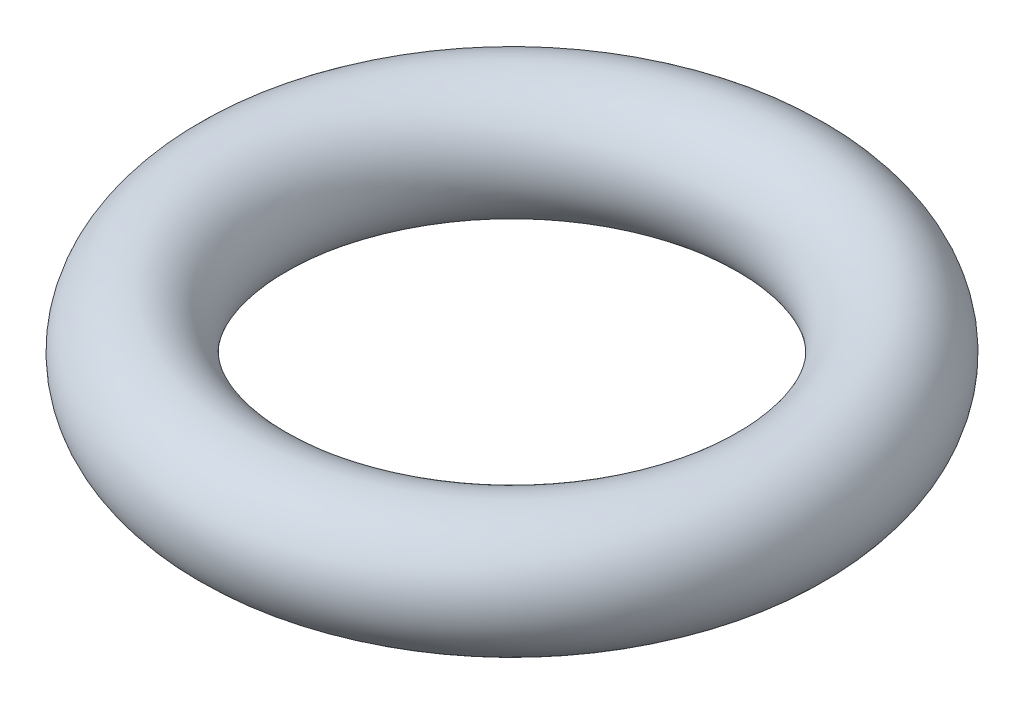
from build123d import *

# Parameters (mm, degrees)
SKETCH2_R = 0.89


with BuildPart() as part:
    # Sweep1: sweep along a path in Sketch1
    with BuildLine(Plane(origin=(0, 0, 0), x_dir=(1, 0, 0), z_dir=(0, 1, 0))) as sweep1_path:
        CenterArc((0, 0), 3.035, 0, 360)
    # Sketch2 → Sweep1 (sweep)
    with BuildSketch(Plane.XY):
        with Locations((-3.925, 0)):
            Circle(SKETCH2_R)
    sweep(path=sweep1_path.line)


solid = part.part
